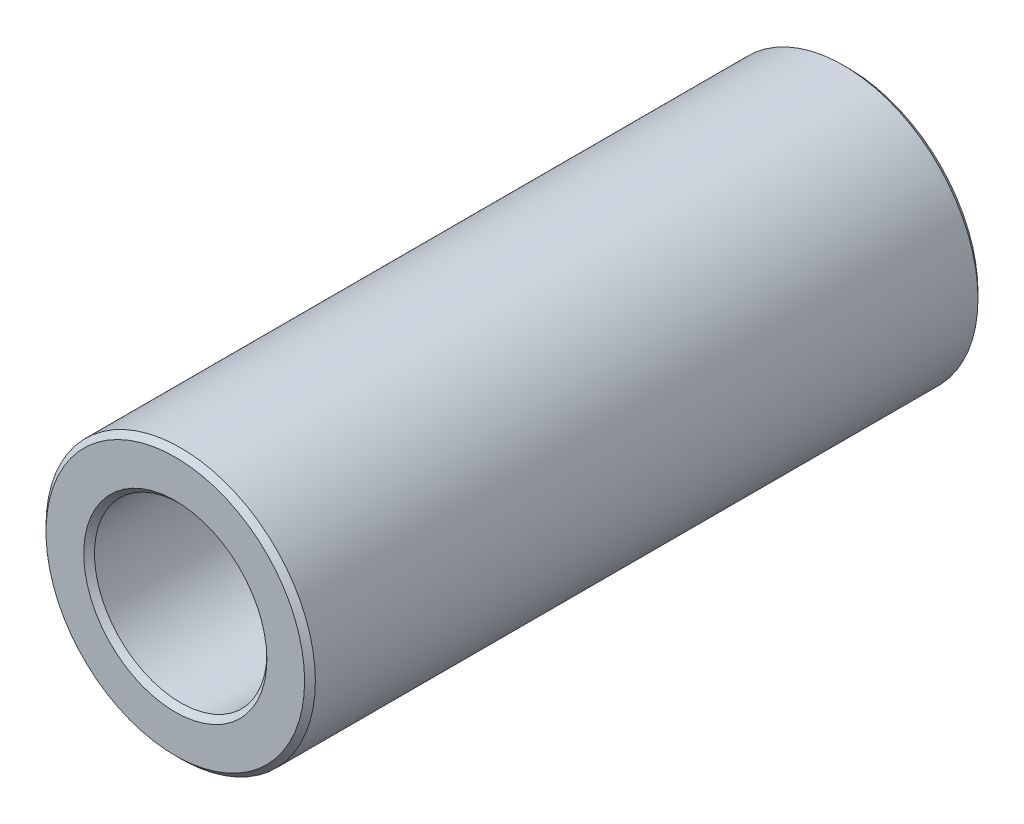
ISO-10303-21;
HEADER;
FILE_DESCRIPTION(('STEP AP214'),'2;1');
FILE_NAME('part.step','',(''),(''),'','','');
FILE_SCHEMA(('AUTOMOTIVE_DESIGN { 1 0 10303 214 1 1 1 1 }'));
ENDSEC;
DATA;
#1=APPLICATION_CONTEXT('core data for automotive mechanical design processes');
#2=APPLICATION_PROTOCOL_DEFINITION('international standard','automotive_design',2000,#1);
#3=PRODUCT_CONTEXT('',#1,'mechanical');
#4=PRODUCT('Part','Part','',(#3));
#5=PRODUCT_RELATED_PRODUCT_CATEGORY('part','',(#4));
#6=PRODUCT_DEFINITION_FORMATION('','',#4);
#7=PRODUCT_DEFINITION_CONTEXT('part definition',#1,'design');
#8=PRODUCT_DEFINITION('design','',#6,#7);
#9=PRODUCT_DEFINITION_SHAPE('','',#8);
#10=(LENGTH_UNIT() NAMED_UNIT(*) SI_UNIT(.MILLI.,.METRE.));
#11=(NAMED_UNIT(*) PLANE_ANGLE_UNIT() SI_UNIT($,.RADIAN.));
#12=(NAMED_UNIT(*) SI_UNIT($,.STERADIAN.) SOLID_ANGLE_UNIT());
#13=UNCERTAINTY_MEASURE_WITH_UNIT(LENGTH_MEASURE(1.E-05),#10,'distance_accuracy_value','');
#14=(GEOMETRIC_REPRESENTATION_CONTEXT(3) GLOBAL_UNCERTAINTY_ASSIGNED_CONTEXT((#13)) GLOBAL_UNIT_ASSIGNED_CONTEXT((#10,
#11,#12)) REPRESENTATION_CONTEXT('',''));
#15=CARTESIAN_POINT('',(0.,0.,0.));
#16=DIRECTION('',(0.,0.,1.));
#17=DIRECTION('',(1.,0.,0.));
#18=AXIS2_PLACEMENT_3D('',#15,#16,#17);
#19=CARTESIAN_POINT('',(0.,0.,12.5));
#20=DIRECTION('',(0.,0.,1.));
#21=DIRECTION('',(1.,0.,0.));
#22=AXIS2_PLACEMENT_3D('',#19,#20,#21);
#23=PLANE('',#22);
#24=CARTESIAN_POINT('',(0.,0.,12.5));
#25=DIRECTION('',(0.,0.,1.));
#26=DIRECTION('',(1.,0.,0.));
#27=AXIS2_PLACEMENT_3D('',#24,#25,#26);
#28=CIRCLE('',#27,3.4);
#29=CARTESIAN_POINT('',(3.4,0.,12.5));
#30=VERTEX_POINT('',#29);
#31=EDGE_CURVE('E10',#30,#30,#28,.F.);
#32=ORIENTED_EDGE('',*,*,#31,.T.);
#33=EDGE_LOOP('',(#32));
#34=FACE_BOUND('',#33,.T.);
#35=CARTESIAN_POINT('',(0.,0.,12.5));
#36=DIRECTION('',(0.,0.,1.));
#37=DIRECTION('',(1.,0.,0.));
#38=AXIS2_PLACEMENT_3D('',#35,#36,#37);
#39=CIRCLE('',#38,4.80000000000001);
#40=CARTESIAN_POINT('',(4.80000000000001,0.,12.5));
#41=VERTEX_POINT('',#40);
#42=EDGE_CURVE('E45',#41,#41,#39,.T.);
#43=ORIENTED_EDGE('',*,*,#42,.T.);
#44=EDGE_LOOP('',(#43));
#45=FACE_BOUND('',#44,.T.);
#46=ADVANCED_FACE('F37',(#34,#45),#23,.T.);
#47=CARTESIAN_POINT('',(0.,0.,-12.5));
#48=DIRECTION('',(0.,0.,1.));
#49=DIRECTION('',(1.,0.,0.));
#50=AXIS2_PLACEMENT_3D('',#47,#48,#49);
#51=PLANE('',#50);
#52=CARTESIAN_POINT('',(0.,0.,-12.5));
#53=DIRECTION('',(0.,0.,1.));
#54=DIRECTION('',(1.,0.,0.));
#55=AXIS2_PLACEMENT_3D('',#52,#53,#54);
#56=CIRCLE('',#55,4.8);
#57=CARTESIAN_POINT('',(4.8,0.,-12.5));
#58=VERTEX_POINT('',#57);
#59=EDGE_CURVE('E62',#58,#58,#56,.F.);
#60=ORIENTED_EDGE('',*,*,#59,.T.);
#61=EDGE_LOOP('',(#60));
#62=FACE_BOUND('',#61,.T.);
#63=CARTESIAN_POINT('',(0.,0.,-12.5));
#64=DIRECTION('',(0.,0.,1.));
#65=DIRECTION('',(1.,0.,0.));
#66=AXIS2_PLACEMENT_3D('',#63,#64,#65);
#67=CIRCLE('',#66,3.4);
#68=CARTESIAN_POINT('',(3.4,0.,-12.5));
#69=VERTEX_POINT('',#68);
#70=EDGE_CURVE('E66',#69,#69,#67,.T.);
#71=ORIENTED_EDGE('',*,*,#70,.T.);
#72=EDGE_LOOP('',(#71));
#73=FACE_BOUND('',#72,.T.);
#74=ADVANCED_FACE('F89',(#62,#73),#51,.F.);
#75=CARTESIAN_POINT('',(0.,0.,12.5));
#76=DIRECTION('',(0.,0.,-1.));
#77=DIRECTION('',(-1.,0.,0.));
#78=AXIS2_PLACEMENT_3D('',#75,#76,#77);
#79=CYLINDRICAL_SURFACE('',#78,5.);
#80=CARTESIAN_POINT('',(0.,0.,-12.3));
#81=DIRECTION('',(0.,0.,1.));
#82=DIRECTION('',(1.,0.,0.));
#83=AXIS2_PLACEMENT_3D('',#80,#81,#82);
#84=CIRCLE('',#83,5.);
#85=CARTESIAN_POINT('',(5.,0.,-12.3));
#86=VERTEX_POINT('',#85);
#87=EDGE_CURVE('E70',#86,#86,#84,.T.);
#88=ORIENTED_EDGE('',*,*,#87,.T.);
#89=EDGE_LOOP('',(#88));
#90=FACE_BOUND('',#89,.T.);
#91=CARTESIAN_POINT('',(0.,0.,12.3));
#92=DIRECTION('',(0.,0.,1.));
#93=DIRECTION('',(1.,0.,0.));
#94=AXIS2_PLACEMENT_3D('',#91,#92,#93);
#95=CIRCLE('',#94,5.);
#96=CARTESIAN_POINT('',(5.,0.,12.3));
#97=VERTEX_POINT('',#96);
#98=EDGE_CURVE('E73',#97,#97,#95,.F.);
#99=ORIENTED_EDGE('',*,*,#98,.T.);
#100=EDGE_LOOP('',(#99));
#101=FACE_BOUND('',#100,.T.);
#102=ADVANCED_FACE('F78',(#90,#101),#79,.T.);
#103=CARTESIAN_POINT('',(0.,0.,12.5));
#104=DIRECTION('',(0.,0.,-1.));
#105=DIRECTION('',(-1.,0.,0.));
#106=AXIS2_PLACEMENT_3D('',#103,#104,#105);
#107=CYLINDRICAL_SURFACE('',#106,3.2);
#108=CARTESIAN_POINT('',(0.,0.,-12.3));
#109=DIRECTION('',(0.,0.,1.));
#110=DIRECTION('',(1.,0.,0.));
#111=AXIS2_PLACEMENT_3D('',#108,#109,#110);
#112=CIRCLE('',#111,3.2);
#113=CARTESIAN_POINT('',(3.2,0.,-12.3));
#114=VERTEX_POINT('',#113);
#115=EDGE_CURVE('E51',#114,#114,#112,.F.);
#116=ORIENTED_EDGE('',*,*,#115,.T.);
#117=EDGE_LOOP('',(#116));
#118=FACE_BOUND('',#117,.T.);
#119=CARTESIAN_POINT('',(0.,0.,12.3));
#120=DIRECTION('',(0.,0.,1.));
#121=DIRECTION('',(1.,0.,0.));
#122=AXIS2_PLACEMENT_3D('',#119,#120,#121);
#123=CIRCLE('',#122,3.2);
#124=CARTESIAN_POINT('',(3.2,0.,12.3));
#125=VERTEX_POINT('',#124);
#126=EDGE_CURVE('E57',#125,#125,#123,.T.);
#127=ORIENTED_EDGE('',*,*,#126,.T.);
#128=EDGE_LOOP('',(#127));
#129=FACE_BOUND('',#128,.T.);
#130=ADVANCED_FACE('F97',(#118,#129),#107,.F.);
#131=CARTESIAN_POINT('',(0.,0.,-12.3));
#132=DIRECTION('',(0.,0.,1.));
#133=DIRECTION('',(1.,0.,0.));
#134=AXIS2_PLACEMENT_3D('',#131,#132,#133);
#135=CONICAL_SURFACE('',#134,5.,0.785398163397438);
#136=ORIENTED_EDGE('',*,*,#59,.F.);
#137=EDGE_LOOP('',(#136));
#138=FACE_BOUND('',#137,.T.);
#139=ORIENTED_EDGE('',*,*,#87,.F.);
#140=EDGE_LOOP('',(#139));
#141=FACE_BOUND('',#140,.T.);
#142=ADVANCED_FACE('F102',(#138,#141),#135,.T.);
#143=CARTESIAN_POINT('',(0.,0.,-12.5));
#144=DIRECTION('',(0.,0.,-1.));
#145=DIRECTION('',(-1.,0.,0.));
#146=AXIS2_PLACEMENT_3D('',#143,#144,#145);
#147=CONICAL_SURFACE('',#146,3.4,0.785398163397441);
#148=ORIENTED_EDGE('',*,*,#115,.F.);
#149=EDGE_LOOP('',(#148));
#150=FACE_BOUND('',#149,.T.);
#151=ORIENTED_EDGE('',*,*,#70,.F.);
#152=EDGE_LOOP('',(#151));
#153=FACE_BOUND('',#152,.T.);
#154=ADVANCED_FACE('F86',(#150,#153),#147,.F.);
#155=CARTESIAN_POINT('',(0.,0.,12.3));
#156=DIRECTION('',(0.,0.,1.));
#157=DIRECTION('',(1.,0.,0.));
#158=AXIS2_PLACEMENT_3D('',#155,#156,#157);
#159=CONICAL_SURFACE('',#158,3.2,0.785398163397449);
#160=ORIENTED_EDGE('',*,*,#31,.F.);
#161=EDGE_LOOP('',(#160));
#162=FACE_BOUND('',#161,.T.);
#163=ORIENTED_EDGE('',*,*,#126,.F.);
#164=EDGE_LOOP('',(#163));
#165=FACE_BOUND('',#164,.T.);
#166=ADVANCED_FACE('F82',(#162,#165),#159,.F.);
#167=CARTESIAN_POINT('',(0.,0.,12.5));
#168=DIRECTION('',(0.,0.,-1.));
#169=DIRECTION('',(-1.,0.,0.));
#170=AXIS2_PLACEMENT_3D('',#167,#168,#169);
#171=CONICAL_SURFACE('',#170,4.80000000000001,0.785398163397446);
#172=ORIENTED_EDGE('',*,*,#98,.F.);
#173=EDGE_LOOP('',(#172));
#174=FACE_BOUND('',#173,.T.);
#175=ORIENTED_EDGE('',*,*,#42,.F.);
#176=EDGE_LOOP('',(#175));
#177=FACE_BOUND('',#176,.T.);
#178=ADVANCED_FACE('F39',(#174,#177),#171,.T.);
#179=CLOSED_SHELL('',(#46,#74,#102,#130,#142,#154,#166,#178));
#180=MANIFOLD_SOLID_BREP('B2',#179);
#181=ADVANCED_BREP_SHAPE_REPRESENTATION('',(#18,#180),#14);
#182=SHAPE_DEFINITION_REPRESENTATION(#9,#181);
ENDSEC;
END-ISO-10303-21;
